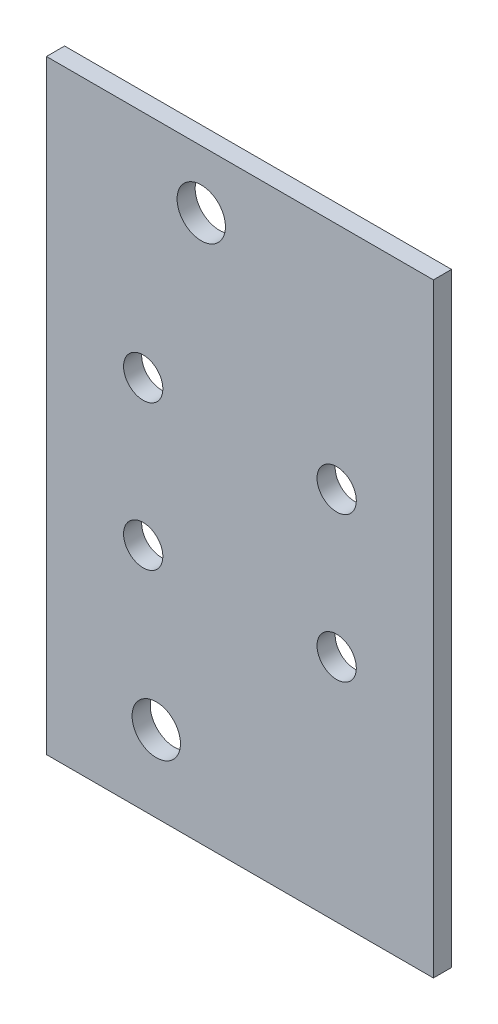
ISO-10303-21;
HEADER;
FILE_DESCRIPTION(('STEP AP214'),'2;1');
FILE_NAME('part.step','',(''),(''),'','','');
FILE_SCHEMA(('AUTOMOTIVE_DESIGN { 1 0 10303 214 1 1 1 1 }'));
ENDSEC;
DATA;
#1=APPLICATION_CONTEXT('core data for automotive mechanical design processes');
#2=APPLICATION_PROTOCOL_DEFINITION('international standard','automotive_design',2000,#1);
#3=PRODUCT_CONTEXT('',#1,'mechanical');
#4=PRODUCT('Part','Part','',(#3));
#5=PRODUCT_RELATED_PRODUCT_CATEGORY('part','',(#4));
#6=PRODUCT_DEFINITION_FORMATION('','',#4);
#7=PRODUCT_DEFINITION_CONTEXT('part definition',#1,'design');
#8=PRODUCT_DEFINITION('design','',#6,#7);
#9=PRODUCT_DEFINITION_SHAPE('','',#8);
#10=(LENGTH_UNIT() NAMED_UNIT(*) SI_UNIT(.MILLI.,.METRE.));
#11=(NAMED_UNIT(*) PLANE_ANGLE_UNIT() SI_UNIT($,.RADIAN.));
#12=(NAMED_UNIT(*) SI_UNIT($,.STERADIAN.) SOLID_ANGLE_UNIT());
#13=UNCERTAINTY_MEASURE_WITH_UNIT(LENGTH_MEASURE(1.E-05),#10,'distance_accuracy_value','');
#14=(GEOMETRIC_REPRESENTATION_CONTEXT(3) GLOBAL_UNCERTAINTY_ASSIGNED_CONTEXT((#13)) GLOBAL_UNIT_ASSIGNED_CONTEXT((#10,
#11,#12)) REPRESENTATION_CONTEXT('',''));
#15=CARTESIAN_POINT('',(0.,0.,0.));
#16=DIRECTION('',(0.,0.,1.));
#17=DIRECTION('',(1.,0.,0.));
#18=AXIS2_PLACEMENT_3D('',#15,#16,#17);
#19=CARTESIAN_POINT('',(0.,0.,9.525));
#20=DIRECTION('',(0.,0.,-1.));
#21=DIRECTION('',(-1.,0.,0.));
#22=AXIS2_PLACEMENT_3D('',#19,#20,#21);
#23=PLANE('',#22);
#24=CARTESIAN_POINT('',(-145.542,-277.368,9.525));
#25=DIRECTION('',(0.,0.,1.));
#26=DIRECTION('',(1.,0.,0.));
#27=AXIS2_PLACEMENT_3D('',#24,#25,#26);
#28=CIRCLE('',#27,12.7);
#29=CARTESIAN_POINT('',(-132.842,-277.368,9.525));
#30=VERTEX_POINT('',#29);
#31=EDGE_CURVE('E140',#30,#30,#28,.T.);
#32=ORIENTED_EDGE('',*,*,#31,.F.);
#33=EDGE_LOOP('',(#32));
#34=FACE_BOUND('',#33,.T.);
#35=CARTESIAN_POINT('',(-121.92,-30.48,9.525));
#36=DIRECTION('',(0.,0.,1.));
#37=DIRECTION('',(1.,0.,0.));
#38=AXIS2_PLACEMENT_3D('',#35,#36,#37);
#39=CIRCLE('',#38,12.7);
#40=CARTESIAN_POINT('',(-109.22,-30.48,9.525));
#41=VERTEX_POINT('',#40);
#42=EDGE_CURVE('E134',#41,#41,#39,.T.);
#43=ORIENTED_EDGE('',*,*,#42,.F.);
#44=EDGE_LOOP('',(#43));
#45=FACE_BOUND('',#44,.T.);
#46=CARTESIAN_POINT('',(-152.4,-196.85,9.525));
#47=DIRECTION('',(0.,0.,-1.));
#48=DIRECTION('',(1.,0.,0.));
#49=AXIS2_PLACEMENT_3D('',#46,#47,#48);
#50=CIRCLE('',#49,10.31875);
#51=CARTESIAN_POINT('',(-142.08125,-196.85,9.525));
#52=VERTEX_POINT('',#51);
#53=EDGE_CURVE('E122',#52,#52,#50,.T.);
#54=ORIENTED_EDGE('',*,*,#53,.T.);
#55=EDGE_LOOP('',(#54));
#56=FACE_BOUND('',#55,.T.);
#57=CARTESIAN_POINT('',(-50.8,-120.65,9.525));
#58=DIRECTION('',(0.,0.,1.));
#59=DIRECTION('',(1.,0.,0.));
#60=AXIS2_PLACEMENT_3D('',#57,#58,#59);
#61=CIRCLE('',#60,10.31875);
#62=CARTESIAN_POINT('',(-40.48125,-120.65,9.525));
#63=VERTEX_POINT('',#62);
#64=EDGE_CURVE('E116',#63,#63,#61,.T.);
#65=ORIENTED_EDGE('',*,*,#64,.F.);
#66=EDGE_LOOP('',(#65));
#67=FACE_BOUND('',#66,.T.);
#68=CARTESIAN_POINT('',(-152.4,-120.65,9.525));
#69=DIRECTION('',(0.,0.,1.));
#70=DIRECTION('',(1.,0.,0.));
#71=AXIS2_PLACEMENT_3D('',#68,#69,#70);
#72=CIRCLE('',#71,10.31875);
#73=CARTESIAN_POINT('',(-142.08125,-120.65,9.525));
#74=VERTEX_POINT('',#73);
#75=EDGE_CURVE('E110',#74,#74,#72,.T.);
#76=ORIENTED_EDGE('',*,*,#75,.F.);
#77=EDGE_LOOP('',(#76));
#78=FACE_BOUND('',#77,.T.);
#79=DIRECTION('',(0.,1.,0.));
#80=VECTOR('',#79,1.);
#81=CARTESIAN_POINT('',(0.,0.,9.525));
#82=LINE('',#81,#80);
#83=CARTESIAN_POINT('',(0.,-317.5,9.525));
#84=VERTEX_POINT('',#83);
#85=CARTESIAN_POINT('',(0.,0.,9.525));
#86=VERTEX_POINT('',#85);
#87=EDGE_CURVE('E83',#84,#86,#82,.T.);
#88=ORIENTED_EDGE('',*,*,#87,.T.);
#89=DIRECTION('',(-1.,0.,0.));
#90=VECTOR('',#89,1.);
#91=CARTESIAN_POINT('',(0.,0.,9.525));
#92=LINE('',#91,#90);
#93=CARTESIAN_POINT('',(-203.2,0.,9.525));
#94=VERTEX_POINT('',#93);
#95=EDGE_CURVE('E78',#86,#94,#92,.T.);
#96=ORIENTED_EDGE('',*,*,#95,.T.);
#97=DIRECTION('',(0.,-1.,0.));
#98=VECTOR('',#97,1.);
#99=CARTESIAN_POINT('',(-203.2,0.,9.525));
#100=LINE('',#99,#98);
#101=CARTESIAN_POINT('',(-203.2,-317.5,9.525));
#102=VERTEX_POINT('',#101);
#103=EDGE_CURVE('E81',#94,#102,#100,.T.);
#104=ORIENTED_EDGE('',*,*,#103,.T.);
#105=DIRECTION('',(1.,0.,0.));
#106=VECTOR('',#105,1.);
#107=CARTESIAN_POINT('',(0.,-317.5,9.525));
#108=LINE('',#107,#106);
#109=EDGE_CURVE('E48',#102,#84,#108,.T.);
#110=ORIENTED_EDGE('',*,*,#109,.T.);
#111=EDGE_LOOP('',(#88,#96,#104,#110));
#112=FACE_BOUND('',#111,.T.);
#113=CARTESIAN_POINT('',(-50.8,-196.85,9.525));
#114=DIRECTION('',(0.,0.,-1.));
#115=DIRECTION('',(1.,0.,0.));
#116=AXIS2_PLACEMENT_3D('',#113,#114,#115);
#117=CIRCLE('',#116,10.31875);
#118=CARTESIAN_POINT('',(-40.48125,-196.85,9.525));
#119=VERTEX_POINT('',#118);
#120=EDGE_CURVE('E128',#119,#119,#117,.T.);
#121=ORIENTED_EDGE('',*,*,#120,.T.);
#122=EDGE_LOOP('',(#121));
#123=FACE_BOUND('',#122,.T.);
#124=ADVANCED_FACE('F31',(#34,#45,#56,#67,#78,#112,#123),#23,.F.);
#125=CARTESIAN_POINT('',(0.,0.,0.));
#126=DIRECTION('',(0.,0.,-1.));
#127=DIRECTION('',(-1.,0.,0.));
#128=AXIS2_PLACEMENT_3D('',#125,#126,#127);
#129=PLANE('',#128);
#130=CARTESIAN_POINT('',(-145.542,-277.368,0.));
#131=DIRECTION('',(0.,0.,1.));
#132=DIRECTION('',(1.,0.,0.));
#133=AXIS2_PLACEMENT_3D('',#130,#131,#132);
#134=CIRCLE('',#133,12.7);
#135=CARTESIAN_POINT('',(-132.842,-277.368,0.));
#136=VERTEX_POINT('',#135);
#137=EDGE_CURVE('E137',#136,#136,#134,.T.);
#138=ORIENTED_EDGE('',*,*,#137,.T.);
#139=EDGE_LOOP('',(#138));
#140=FACE_BOUND('',#139,.T.);
#141=CARTESIAN_POINT('',(-121.92,-30.48,0.));
#142=DIRECTION('',(0.,0.,1.));
#143=DIRECTION('',(1.,0.,0.));
#144=AXIS2_PLACEMENT_3D('',#141,#142,#143);
#145=CIRCLE('',#144,12.7);
#146=CARTESIAN_POINT('',(-109.22,-30.48,0.));
#147=VERTEX_POINT('',#146);
#148=EDGE_CURVE('E131',#147,#147,#145,.T.);
#149=ORIENTED_EDGE('',*,*,#148,.T.);
#150=EDGE_LOOP('',(#149));
#151=FACE_BOUND('',#150,.T.);
#152=CARTESIAN_POINT('',(-152.4,-196.85,0.));
#153=DIRECTION('',(0.,0.,-1.));
#154=DIRECTION('',(1.,0.,0.));
#155=AXIS2_PLACEMENT_3D('',#152,#153,#154);
#156=CIRCLE('',#155,10.31875);
#157=CARTESIAN_POINT('',(-142.08125,-196.85,0.));
#158=VERTEX_POINT('',#157);
#159=EDGE_CURVE('E119',#158,#158,#156,.T.);
#160=ORIENTED_EDGE('',*,*,#159,.F.);
#161=EDGE_LOOP('',(#160));
#162=FACE_BOUND('',#161,.T.);
#163=CARTESIAN_POINT('',(-50.8,-120.65,0.));
#164=DIRECTION('',(0.,0.,1.));
#165=DIRECTION('',(1.,0.,0.));
#166=AXIS2_PLACEMENT_3D('',#163,#164,#165);
#167=CIRCLE('',#166,10.31875);
#168=CARTESIAN_POINT('',(-40.48125,-120.65,0.));
#169=VERTEX_POINT('',#168);
#170=EDGE_CURVE('E113',#169,#169,#167,.T.);
#171=ORIENTED_EDGE('',*,*,#170,.T.);
#172=EDGE_LOOP('',(#171));
#173=FACE_BOUND('',#172,.T.);
#174=CARTESIAN_POINT('',(-152.4,-120.65,0.));
#175=DIRECTION('',(0.,0.,1.));
#176=DIRECTION('',(1.,0.,0.));
#177=AXIS2_PLACEMENT_3D('',#174,#175,#176);
#178=CIRCLE('',#177,10.31875);
#179=CARTESIAN_POINT('',(-142.08125,-120.65,0.));
#180=VERTEX_POINT('',#179);
#181=EDGE_CURVE('E98',#180,#180,#178,.T.);
#182=ORIENTED_EDGE('',*,*,#181,.T.);
#183=EDGE_LOOP('',(#182));
#184=FACE_BOUND('',#183,.T.);
#185=DIRECTION('',(0.,1.,0.));
#186=VECTOR('',#185,1.);
#187=CARTESIAN_POINT('',(0.,0.,0.));
#188=LINE('',#187,#186);
#189=CARTESIAN_POINT('',(0.,-317.5,0.));
#190=VERTEX_POINT('',#189);
#191=CARTESIAN_POINT('',(0.,0.,0.));
#192=VERTEX_POINT('',#191);
#193=EDGE_CURVE('E95',#190,#192,#188,.T.);
#194=ORIENTED_EDGE('',*,*,#193,.F.);
#195=DIRECTION('',(1.,0.,0.));
#196=VECTOR('',#195,1.);
#197=CARTESIAN_POINT('',(0.,-317.5,0.));
#198=LINE('',#197,#196);
#199=CARTESIAN_POINT('',(-203.2,-317.5,0.));
#200=VERTEX_POINT('',#199);
#201=EDGE_CURVE('E71',#200,#190,#198,.T.);
#202=ORIENTED_EDGE('',*,*,#201,.F.);
#203=DIRECTION('',(0.,-1.,0.));
#204=VECTOR('',#203,1.);
#205=CARTESIAN_POINT('',(-203.2,0.,0.));
#206=LINE('',#205,#204);
#207=CARTESIAN_POINT('',(-203.2,0.,0.));
#208=VERTEX_POINT('',#207);
#209=EDGE_CURVE('E65',#208,#200,#206,.T.);
#210=ORIENTED_EDGE('',*,*,#209,.F.);
#211=DIRECTION('',(-1.,0.,0.));
#212=VECTOR('',#211,1.);
#213=CARTESIAN_POINT('',(0.,0.,0.));
#214=LINE('',#213,#212);
#215=EDGE_CURVE('E87',#192,#208,#214,.T.);
#216=ORIENTED_EDGE('',*,*,#215,.F.);
#217=EDGE_LOOP('',(#194,#202,#210,#216));
#218=FACE_BOUND('',#217,.T.);
#219=CARTESIAN_POINT('',(-50.8,-196.85,0.));
#220=DIRECTION('',(0.,0.,-1.));
#221=DIRECTION('',(1.,0.,0.));
#222=AXIS2_PLACEMENT_3D('',#219,#220,#221);
#223=CIRCLE('',#222,10.31875);
#224=CARTESIAN_POINT('',(-40.48125,-196.85,0.));
#225=VERTEX_POINT('',#224);
#226=EDGE_CURVE('E125',#225,#225,#223,.T.);
#227=ORIENTED_EDGE('',*,*,#226,.F.);
#228=EDGE_LOOP('',(#227));
#229=FACE_BOUND('',#228,.T.);
#230=ADVANCED_FACE('F106',(#140,#151,#162,#173,#184,#218,#229),#129,.T.);
#231=CARTESIAN_POINT('',(0.,0.,9.525));
#232=DIRECTION('',(-1.,0.,0.));
#233=DIRECTION('',(0.,-1.,0.));
#234=AXIS2_PLACEMENT_3D('',#231,#232,#233);
#235=PLANE('',#234);
#236=ORIENTED_EDGE('',*,*,#193,.T.);
#237=DIRECTION('',(0.,0.,-1.));
#238=VECTOR('',#237,1.);
#239=CARTESIAN_POINT('',(0.,0.,9.525));
#240=LINE('',#239,#238);
#241=EDGE_CURVE('E11',#86,#192,#240,.T.);
#242=ORIENTED_EDGE('',*,*,#241,.F.);
#243=ORIENTED_EDGE('',*,*,#87,.F.);
#244=DIRECTION('',(0.,0.,-1.));
#245=VECTOR('',#244,1.);
#246=CARTESIAN_POINT('',(0.,-317.5,9.525));
#247=LINE('',#246,#245);
#248=EDGE_CURVE('E91',#84,#190,#247,.T.);
#249=ORIENTED_EDGE('',*,*,#248,.T.);
#250=EDGE_LOOP('',(#236,#242,#243,#249));
#251=FACE_BOUND('',#250,.T.);
#252=ADVANCED_FACE('F33',(#251),#235,.F.);
#253=CARTESIAN_POINT('',(0.,0.,9.525));
#254=DIRECTION('',(0.,-1.,0.));
#255=DIRECTION('',(1.,0.,0.));
#256=AXIS2_PLACEMENT_3D('',#253,#254,#255);
#257=PLANE('',#256);
#258=ORIENTED_EDGE('',*,*,#215,.T.);
#259=DIRECTION('',(0.,0.,-1.));
#260=VECTOR('',#259,1.);
#261=CARTESIAN_POINT('',(-203.2,0.,9.525));
#262=LINE('',#261,#260);
#263=EDGE_CURVE('E40',#94,#208,#262,.T.);
#264=ORIENTED_EDGE('',*,*,#263,.F.);
#265=ORIENTED_EDGE('',*,*,#95,.F.);
#266=ORIENTED_EDGE('',*,*,#241,.T.);
#267=EDGE_LOOP('',(#258,#264,#265,#266));
#268=FACE_BOUND('',#267,.T.);
#269=ADVANCED_FACE('F86',(#268),#257,.F.);
#270=CARTESIAN_POINT('',(-203.2,0.,9.525));
#271=DIRECTION('',(1.,0.,0.));
#272=DIRECTION('',(0.,1.,0.));
#273=AXIS2_PLACEMENT_3D('',#270,#271,#272);
#274=PLANE('',#273);
#275=ORIENTED_EDGE('',*,*,#209,.T.);
#276=DIRECTION('',(0.,0.,-1.));
#277=VECTOR('',#276,1.);
#278=CARTESIAN_POINT('',(-203.2,-317.5,9.525));
#279=LINE('',#278,#277);
#280=EDGE_CURVE('E88',#102,#200,#279,.T.);
#281=ORIENTED_EDGE('',*,*,#280,.F.);
#282=ORIENTED_EDGE('',*,*,#103,.F.);
#283=ORIENTED_EDGE('',*,*,#263,.T.);
#284=EDGE_LOOP('',(#275,#281,#282,#283));
#285=FACE_BOUND('',#284,.T.);
#286=ADVANCED_FACE('F89',(#285),#274,.F.);
#287=CARTESIAN_POINT('',(0.,-317.5,9.525));
#288=DIRECTION('',(0.,1.,0.));
#289=DIRECTION('',(0.,0.,1.));
#290=AXIS2_PLACEMENT_3D('',#287,#288,#289);
#291=PLANE('',#290);
#292=ORIENTED_EDGE('',*,*,#201,.T.);
#293=ORIENTED_EDGE('',*,*,#248,.F.);
#294=ORIENTED_EDGE('',*,*,#109,.F.);
#295=ORIENTED_EDGE('',*,*,#280,.T.);
#296=EDGE_LOOP('',(#292,#293,#294,#295));
#297=FACE_BOUND('',#296,.T.);
#298=ADVANCED_FACE('F103',(#297),#291,.F.);
#299=CARTESIAN_POINT('',(-152.4,-120.65,0.));
#300=DIRECTION('',(0.,0.,1.));
#301=DIRECTION('',(1.,0.,0.));
#302=AXIS2_PLACEMENT_3D('',#299,#300,#301);
#303=CYLINDRICAL_SURFACE('',#302,10.31875);
#304=CARTESIAN_POINT('',(-142.08125,-120.65,0.));
#305=CARTESIAN_POINT('',(-142.08125,-120.65,0.0992187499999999));
#306=CARTESIAN_POINT('',(-142.08125,-120.65,0.1984375));
#307=CARTESIAN_POINT('',(-142.08125,-120.65,0.396875));
#308=CARTESIAN_POINT('',(-142.08125,-120.65,0.49609375));
#309=CARTESIAN_POINT('',(-142.08125,-120.65,0.69453125));
#310=CARTESIAN_POINT('',(-142.08125,-120.65,0.79375));
#311=CARTESIAN_POINT('',(-142.08125,-120.65,0.9921875));
#312=CARTESIAN_POINT('',(-142.08125,-120.65,1.09140625));
#313=CARTESIAN_POINT('',(-142.08125,-120.65,1.28984375));
#314=CARTESIAN_POINT('',(-142.08125,-120.65,1.3890625));
#315=CARTESIAN_POINT('',(-142.08125,-120.65,1.5875));
#316=CARTESIAN_POINT('',(-142.08125,-120.65,1.68671875));
#317=CARTESIAN_POINT('',(-142.08125,-120.65,1.88515625));
#318=CARTESIAN_POINT('',(-142.08125,-120.65,1.984375));
#319=CARTESIAN_POINT('',(-142.08125,-120.65,2.1828125));
#320=CARTESIAN_POINT('',(-142.08125,-120.65,2.28203125));
#321=CARTESIAN_POINT('',(-142.08125,-120.65,2.48046875));
#322=CARTESIAN_POINT('',(-142.08125,-120.65,2.5796875));
#323=CARTESIAN_POINT('',(-142.08125,-120.65,2.778125));
#324=CARTESIAN_POINT('',(-142.08125,-120.65,2.87734375));
#325=CARTESIAN_POINT('',(-142.08125,-120.65,3.07578125));
#326=CARTESIAN_POINT('',(-142.08125,-120.65,3.175));
#327=CARTESIAN_POINT('',(-142.08125,-120.65,3.3734375));
#328=CARTESIAN_POINT('',(-142.08125,-120.65,3.47265625));
#329=CARTESIAN_POINT('',(-142.08125,-120.65,3.67109375));
#330=CARTESIAN_POINT('',(-142.08125,-120.65,3.7703125));
#331=CARTESIAN_POINT('',(-142.08125,-120.65,3.96875));
#332=CARTESIAN_POINT('',(-142.08125,-120.65,4.06796875));
#333=CARTESIAN_POINT('',(-142.08125,-120.65,4.26640625));
#334=CARTESIAN_POINT('',(-142.08125,-120.65,4.365625));
#335=CARTESIAN_POINT('',(-142.08125,-120.65,4.5640625));
#336=CARTESIAN_POINT('',(-142.08125,-120.65,4.66328125));
#337=CARTESIAN_POINT('',(-142.08125,-120.65,4.86171875));
#338=CARTESIAN_POINT('',(-142.08125,-120.65,4.9609375));
#339=CARTESIAN_POINT('',(-142.08125,-120.65,5.159375));
#340=CARTESIAN_POINT('',(-142.08125,-120.65,5.25859375));
#341=CARTESIAN_POINT('',(-142.08125,-120.65,5.45703125));
#342=CARTESIAN_POINT('',(-142.08125,-120.65,5.55625));
#343=CARTESIAN_POINT('',(-142.08125,-120.65,5.7546875));
#344=CARTESIAN_POINT('',(-142.08125,-120.65,5.85390625));
#345=CARTESIAN_POINT('',(-142.08125,-120.65,6.05234375));
#346=CARTESIAN_POINT('',(-142.08125,-120.65,6.1515625));
#347=CARTESIAN_POINT('',(-142.08125,-120.65,6.35));
#348=CARTESIAN_POINT('',(-142.08125,-120.65,6.44921875));
#349=CARTESIAN_POINT('',(-142.08125,-120.65,6.64765625));
#350=CARTESIAN_POINT('',(-142.08125,-120.65,6.746875));
#351=CARTESIAN_POINT('',(-142.08125,-120.65,6.9453125));
#352=CARTESIAN_POINT('',(-142.08125,-120.65,7.04453125));
#353=CARTESIAN_POINT('',(-142.08125,-120.65,7.24296875));
#354=CARTESIAN_POINT('',(-142.08125,-120.65,7.3421875));
#355=CARTESIAN_POINT('',(-142.08125,-120.65,7.540625));
#356=CARTESIAN_POINT('',(-142.08125,-120.65,7.63984375));
#357=CARTESIAN_POINT('',(-142.08125,-120.65,7.83828125));
#358=CARTESIAN_POINT('',(-142.08125,-120.65,7.9375));
#359=CARTESIAN_POINT('',(-142.08125,-120.65,8.1359375));
#360=CARTESIAN_POINT('',(-142.08125,-120.65,8.23515625));
#361=CARTESIAN_POINT('',(-142.08125,-120.65,8.43359375));
#362=CARTESIAN_POINT('',(-142.08125,-120.65,8.5328125));
#363=CARTESIAN_POINT('',(-142.08125,-120.65,8.73125));
#364=CARTESIAN_POINT('',(-142.08125,-120.65,8.83046875));
#365=CARTESIAN_POINT('',(-142.08125,-120.65,9.02890625));
#366=CARTESIAN_POINT('',(-142.08125,-120.65,9.128125));
#367=CARTESIAN_POINT('',(-142.08125,-120.65,9.3265625));
#368=CARTESIAN_POINT('',(-142.08125,-120.65,9.42578125));
#369=CARTESIAN_POINT('',(-142.08125,-120.65,9.525));
#370=B_SPLINE_CURVE_WITH_KNOTS('',3,(#304,#305,#306,#307,#308,#309,#310,#311,#312,#313,#314,
#315,#316,#317,#318,#319,#320,#321,#322,#323,#324,#325,#326,#327,#328,#329,#330,#331,#332,#333,
#334,#335,#336,#337,#338,#339,#340,#341,#342,#343,#344,#345,#346,#347,#348,#349,#350,#351,#352,
#353,#354,#355,#356,#357,#358,#359,#360,#361,#362,#363,#364,#365,#366,#367,#368,#369),
.UNSPECIFIED.,.F.,.F.,(4,2,2,2,2,2,2,2,2,2,2,2,2,2,2,2,2,2,2,2,2,2,2,2,2,2,2,2,2,2,2,2,4),(0.,
0.29765625,0.5953125,0.89296875,1.190625,1.48828125,1.7859375,2.08359375,2.38125,2.67890625,
2.9765625,3.27421875,3.571875,3.86953125,4.1671875,4.46484375,4.7625,5.06015625,5.3578125,
5.65546875,5.953125,6.25078125,6.5484375,6.84609375,7.14375,7.44140625,7.7390625,8.03671875,
8.334375,8.63203125,8.9296875,9.22734375,9.525),.UNSPECIFIED.);
#371=EDGE_CURVE('BSEAM166',#180,#74,#370,.T.);
#372=ORIENTED_EDGE('',*,*,#181,.F.);
#373=ORIENTED_EDGE('',*,*,#75,.T.);
#374=ORIENTED_EDGE('',*,*,#371,.T.);
#375=ORIENTED_EDGE('',*,*,#371,.F.);
#376=EDGE_LOOP('',(#372,#374,#373,#375));
#377=FACE_BOUND('',#376,.T.);
#378=ADVANCED_FACE('F166',(#377),#303,.F.);
#379=CARTESIAN_POINT('',(-50.8,-120.65,0.));
#380=DIRECTION('',(0.,0.,1.));
#381=DIRECTION('',(1.,0.,0.));
#382=AXIS2_PLACEMENT_3D('',#379,#380,#381);
#383=CYLINDRICAL_SURFACE('',#382,10.31875);
#384=CARTESIAN_POINT('',(-40.48125,-120.65,0.));
#385=CARTESIAN_POINT('',(-40.48125,-120.65,0.0992187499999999));
#386=CARTESIAN_POINT('',(-40.48125,-120.65,0.1984375));
#387=CARTESIAN_POINT('',(-40.48125,-120.65,0.396875));
#388=CARTESIAN_POINT('',(-40.48125,-120.65,0.49609375));
#389=CARTESIAN_POINT('',(-40.48125,-120.65,0.69453125));
#390=CARTESIAN_POINT('',(-40.48125,-120.65,0.79375));
#391=CARTESIAN_POINT('',(-40.48125,-120.65,0.9921875));
#392=CARTESIAN_POINT('',(-40.48125,-120.65,1.09140625));
#393=CARTESIAN_POINT('',(-40.48125,-120.65,1.28984375));
#394=CARTESIAN_POINT('',(-40.48125,-120.65,1.3890625));
#395=CARTESIAN_POINT('',(-40.48125,-120.65,1.5875));
#396=CARTESIAN_POINT('',(-40.48125,-120.65,1.68671875));
#397=CARTESIAN_POINT('',(-40.48125,-120.65,1.88515625));
#398=CARTESIAN_POINT('',(-40.48125,-120.65,1.984375));
#399=CARTESIAN_POINT('',(-40.48125,-120.65,2.1828125));
#400=CARTESIAN_POINT('',(-40.48125,-120.65,2.28203125));
#401=CARTESIAN_POINT('',(-40.48125,-120.65,2.48046875));
#402=CARTESIAN_POINT('',(-40.48125,-120.65,2.5796875));
#403=CARTESIAN_POINT('',(-40.48125,-120.65,2.778125));
#404=CARTESIAN_POINT('',(-40.48125,-120.65,2.87734375));
#405=CARTESIAN_POINT('',(-40.48125,-120.65,3.07578125));
#406=CARTESIAN_POINT('',(-40.48125,-120.65,3.175));
#407=CARTESIAN_POINT('',(-40.48125,-120.65,3.3734375));
#408=CARTESIAN_POINT('',(-40.48125,-120.65,3.47265625));
#409=CARTESIAN_POINT('',(-40.48125,-120.65,3.67109375));
#410=CARTESIAN_POINT('',(-40.48125,-120.65,3.7703125));
#411=CARTESIAN_POINT('',(-40.48125,-120.65,3.96875));
#412=CARTESIAN_POINT('',(-40.48125,-120.65,4.06796875));
#413=CARTESIAN_POINT('',(-40.48125,-120.65,4.26640625));
#414=CARTESIAN_POINT('',(-40.48125,-120.65,4.365625));
#415=CARTESIAN_POINT('',(-40.48125,-120.65,4.5640625));
#416=CARTESIAN_POINT('',(-40.48125,-120.65,4.66328125));
#417=CARTESIAN_POINT('',(-40.48125,-120.65,4.86171875));
#418=CARTESIAN_POINT('',(-40.48125,-120.65,4.9609375));
#419=CARTESIAN_POINT('',(-40.48125,-120.65,5.159375));
#420=CARTESIAN_POINT('',(-40.48125,-120.65,5.25859375));
#421=CARTESIAN_POINT('',(-40.48125,-120.65,5.45703125));
#422=CARTESIAN_POINT('',(-40.48125,-120.65,5.55625));
#423=CARTESIAN_POINT('',(-40.48125,-120.65,5.7546875));
#424=CARTESIAN_POINT('',(-40.48125,-120.65,5.85390625));
#425=CARTESIAN_POINT('',(-40.48125,-120.65,6.05234375));
#426=CARTESIAN_POINT('',(-40.48125,-120.65,6.1515625));
#427=CARTESIAN_POINT('',(-40.48125,-120.65,6.35));
#428=CARTESIAN_POINT('',(-40.48125,-120.65,6.44921875));
#429=CARTESIAN_POINT('',(-40.48125,-120.65,6.64765625));
#430=CARTESIAN_POINT('',(-40.48125,-120.65,6.746875));
#431=CARTESIAN_POINT('',(-40.48125,-120.65,6.9453125));
#432=CARTESIAN_POINT('',(-40.48125,-120.65,7.04453125));
#433=CARTESIAN_POINT('',(-40.48125,-120.65,7.24296875));
#434=CARTESIAN_POINT('',(-40.48125,-120.65,7.3421875));
#435=CARTESIAN_POINT('',(-40.48125,-120.65,7.540625));
#436=CARTESIAN_POINT('',(-40.48125,-120.65,7.63984375));
#437=CARTESIAN_POINT('',(-40.48125,-120.65,7.83828125));
#438=CARTESIAN_POINT('',(-40.48125,-120.65,7.9375));
#439=CARTESIAN_POINT('',(-40.48125,-120.65,8.1359375));
#440=CARTESIAN_POINT('',(-40.48125,-120.65,8.23515625));
#441=CARTESIAN_POINT('',(-40.48125,-120.65,8.43359375));
#442=CARTESIAN_POINT('',(-40.48125,-120.65,8.5328125));
#443=CARTESIAN_POINT('',(-40.48125,-120.65,8.73125));
#444=CARTESIAN_POINT('',(-40.48125,-120.65,8.83046875));
#445=CARTESIAN_POINT('',(-40.48125,-120.65,9.02890625));
#446=CARTESIAN_POINT('',(-40.48125,-120.65,9.128125));
#447=CARTESIAN_POINT('',(-40.48125,-120.65,9.3265625));
#448=CARTESIAN_POINT('',(-40.48125,-120.65,9.42578125));
#449=CARTESIAN_POINT('',(-40.48125,-120.65,9.525));
#450=B_SPLINE_CURVE_WITH_KNOTS('',3,(#384,#385,#386,#387,#388,#389,#390,#391,#392,#393,#394,
#395,#396,#397,#398,#399,#400,#401,#402,#403,#404,#405,#406,#407,#408,#409,#410,#411,#412,#413,
#414,#415,#416,#417,#418,#419,#420,#421,#422,#423,#424,#425,#426,#427,#428,#429,#430,#431,#432,
#433,#434,#435,#436,#437,#438,#439,#440,#441,#442,#443,#444,#445,#446,#447,#448,#449),
.UNSPECIFIED.,.F.,.F.,(4,2,2,2,2,2,2,2,2,2,2,2,2,2,2,2,2,2,2,2,2,2,2,2,2,2,2,2,2,2,2,2,4),(0.,
0.29765625,0.5953125,0.89296875,1.190625,1.48828125,1.7859375,2.08359375,2.38125,2.67890625,
2.9765625,3.27421875,3.571875,3.86953125,4.1671875,4.46484375,4.7625,5.06015625,5.3578125,
5.65546875,5.953125,6.25078125,6.5484375,6.84609375,7.14375,7.44140625,7.7390625,8.03671875,
8.334375,8.63203125,8.9296875,9.22734375,9.525),.UNSPECIFIED.);
#451=EDGE_CURVE('BSEAM168',#169,#63,#450,.T.);
#452=ORIENTED_EDGE('',*,*,#170,.F.);
#453=ORIENTED_EDGE('',*,*,#64,.T.);
#454=ORIENTED_EDGE('',*,*,#451,.T.);
#455=ORIENTED_EDGE('',*,*,#451,.F.);
#456=EDGE_LOOP('',(#452,#454,#453,#455));
#457=FACE_BOUND('',#456,.T.);
#458=ADVANCED_FACE('F168',(#457),#383,.F.);
#459=CARTESIAN_POINT('',(-152.4,-196.85,0.));
#460=DIRECTION('',(0.,0.,1.));
#461=DIRECTION('',(1.,0.,0.));
#462=AXIS2_PLACEMENT_3D('',#459,#460,#461);
#463=CYLINDRICAL_SURFACE('',#462,10.31875);
#464=CARTESIAN_POINT('',(-142.08125,-196.85,0.));
#465=CARTESIAN_POINT('',(-142.08125,-196.85,0.0992187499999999));
#466=CARTESIAN_POINT('',(-142.08125,-196.85,0.1984375));
#467=CARTESIAN_POINT('',(-142.08125,-196.85,0.396875));
#468=CARTESIAN_POINT('',(-142.08125,-196.85,0.49609375));
#469=CARTESIAN_POINT('',(-142.08125,-196.85,0.69453125));
#470=CARTESIAN_POINT('',(-142.08125,-196.85,0.79375));
#471=CARTESIAN_POINT('',(-142.08125,-196.85,0.9921875));
#472=CARTESIAN_POINT('',(-142.08125,-196.85,1.09140625));
#473=CARTESIAN_POINT('',(-142.08125,-196.85,1.28984375));
#474=CARTESIAN_POINT('',(-142.08125,-196.85,1.3890625));
#475=CARTESIAN_POINT('',(-142.08125,-196.85,1.5875));
#476=CARTESIAN_POINT('',(-142.08125,-196.85,1.68671875));
#477=CARTESIAN_POINT('',(-142.08125,-196.85,1.88515625));
#478=CARTESIAN_POINT('',(-142.08125,-196.85,1.984375));
#479=CARTESIAN_POINT('',(-142.08125,-196.85,2.1828125));
#480=CARTESIAN_POINT('',(-142.08125,-196.85,2.28203125));
#481=CARTESIAN_POINT('',(-142.08125,-196.85,2.48046875));
#482=CARTESIAN_POINT('',(-142.08125,-196.85,2.5796875));
#483=CARTESIAN_POINT('',(-142.08125,-196.85,2.778125));
#484=CARTESIAN_POINT('',(-142.08125,-196.85,2.87734375));
#485=CARTESIAN_POINT('',(-142.08125,-196.85,3.07578125));
#486=CARTESIAN_POINT('',(-142.08125,-196.85,3.175));
#487=CARTESIAN_POINT('',(-142.08125,-196.85,3.3734375));
#488=CARTESIAN_POINT('',(-142.08125,-196.85,3.47265625));
#489=CARTESIAN_POINT('',(-142.08125,-196.85,3.67109375));
#490=CARTESIAN_POINT('',(-142.08125,-196.85,3.7703125));
#491=CARTESIAN_POINT('',(-142.08125,-196.85,3.96875));
#492=CARTESIAN_POINT('',(-142.08125,-196.85,4.06796875));
#493=CARTESIAN_POINT('',(-142.08125,-196.85,4.26640625));
#494=CARTESIAN_POINT('',(-142.08125,-196.85,4.365625));
#495=CARTESIAN_POINT('',(-142.08125,-196.85,4.5640625));
#496=CARTESIAN_POINT('',(-142.08125,-196.85,4.66328125));
#497=CARTESIAN_POINT('',(-142.08125,-196.85,4.86171875));
#498=CARTESIAN_POINT('',(-142.08125,-196.85,4.9609375));
#499=CARTESIAN_POINT('',(-142.08125,-196.85,5.159375));
#500=CARTESIAN_POINT('',(-142.08125,-196.85,5.25859375));
#501=CARTESIAN_POINT('',(-142.08125,-196.85,5.45703125));
#502=CARTESIAN_POINT('',(-142.08125,-196.85,5.55625));
#503=CARTESIAN_POINT('',(-142.08125,-196.85,5.7546875));
#504=CARTESIAN_POINT('',(-142.08125,-196.85,5.85390625));
#505=CARTESIAN_POINT('',(-142.08125,-196.85,6.05234375));
#506=CARTESIAN_POINT('',(-142.08125,-196.85,6.1515625));
#507=CARTESIAN_POINT('',(-142.08125,-196.85,6.35));
#508=CARTESIAN_POINT('',(-142.08125,-196.85,6.44921875));
#509=CARTESIAN_POINT('',(-142.08125,-196.85,6.64765625));
#510=CARTESIAN_POINT('',(-142.08125,-196.85,6.746875));
#511=CARTESIAN_POINT('',(-142.08125,-196.85,6.9453125));
#512=CARTESIAN_POINT('',(-142.08125,-196.85,7.04453125));
#513=CARTESIAN_POINT('',(-142.08125,-196.85,7.24296875));
#514=CARTESIAN_POINT('',(-142.08125,-196.85,7.3421875));
#515=CARTESIAN_POINT('',(-142.08125,-196.85,7.540625));
#516=CARTESIAN_POINT('',(-142.08125,-196.85,7.63984375));
#517=CARTESIAN_POINT('',(-142.08125,-196.85,7.83828125));
#518=CARTESIAN_POINT('',(-142.08125,-196.85,7.9375));
#519=CARTESIAN_POINT('',(-142.08125,-196.85,8.1359375));
#520=CARTESIAN_POINT('',(-142.08125,-196.85,8.23515625));
#521=CARTESIAN_POINT('',(-142.08125,-196.85,8.43359375));
#522=CARTESIAN_POINT('',(-142.08125,-196.85,8.5328125));
#523=CARTESIAN_POINT('',(-142.08125,-196.85,8.73125));
#524=CARTESIAN_POINT('',(-142.08125,-196.85,8.83046875));
#525=CARTESIAN_POINT('',(-142.08125,-196.85,9.02890625));
#526=CARTESIAN_POINT('',(-142.08125,-196.85,9.128125));
#527=CARTESIAN_POINT('',(-142.08125,-196.85,9.3265625));
#528=CARTESIAN_POINT('',(-142.08125,-196.85,9.42578125));
#529=CARTESIAN_POINT('',(-142.08125,-196.85,9.525));
#530=B_SPLINE_CURVE_WITH_KNOTS('',3,(#464,#465,#466,#467,#468,#469,#470,#471,#472,#473,#474,
#475,#476,#477,#478,#479,#480,#481,#482,#483,#484,#485,#486,#487,#488,#489,#490,#491,#492,#493,
#494,#495,#496,#497,#498,#499,#500,#501,#502,#503,#504,#505,#506,#507,#508,#509,#510,#511,#512,
#513,#514,#515,#516,#517,#518,#519,#520,#521,#522,#523,#524,#525,#526,#527,#528,#529),
.UNSPECIFIED.,.F.,.F.,(4,2,2,2,2,2,2,2,2,2,2,2,2,2,2,2,2,2,2,2,2,2,2,2,2,2,2,2,2,2,2,2,4),(0.,
0.29765625,0.5953125,0.89296875,1.190625,1.48828125,1.7859375,2.08359375,2.38125,2.67890625,
2.9765625,3.27421875,3.571875,3.86953125,4.1671875,4.46484375,4.7625,5.06015625,5.3578125,
5.65546875,5.953125,6.25078125,6.5484375,6.84609375,7.14375,7.44140625,7.7390625,8.03671875,
8.334375,8.63203125,8.9296875,9.22734375,9.525),.UNSPECIFIED.);
#531=EDGE_CURVE('BSEAM175',#158,#52,#530,.T.);
#532=ORIENTED_EDGE('',*,*,#159,.T.);
#533=ORIENTED_EDGE('',*,*,#53,.F.);
#534=ORIENTED_EDGE('',*,*,#531,.T.);
#535=ORIENTED_EDGE('',*,*,#531,.F.);
#536=EDGE_LOOP('',(#532,#534,#533,#535));
#537=FACE_BOUND('',#536,.T.);
#538=ADVANCED_FACE('F175',(#537),#463,.F.);
#539=CARTESIAN_POINT('',(-50.8,-196.85,0.));
#540=DIRECTION('',(0.,0.,1.));
#541=DIRECTION('',(1.,0.,0.));
#542=AXIS2_PLACEMENT_3D('',#539,#540,#541);
#543=CYLINDRICAL_SURFACE('',#542,10.31875);
#544=CARTESIAN_POINT('',(-40.48125,-196.85,0.));
#545=CARTESIAN_POINT('',(-40.48125,-196.85,0.0992187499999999));
#546=CARTESIAN_POINT('',(-40.48125,-196.85,0.1984375));
#547=CARTESIAN_POINT('',(-40.48125,-196.85,0.396875));
#548=CARTESIAN_POINT('',(-40.48125,-196.85,0.49609375));
#549=CARTESIAN_POINT('',(-40.48125,-196.85,0.69453125));
#550=CARTESIAN_POINT('',(-40.48125,-196.85,0.79375));
#551=CARTESIAN_POINT('',(-40.48125,-196.85,0.9921875));
#552=CARTESIAN_POINT('',(-40.48125,-196.85,1.09140625));
#553=CARTESIAN_POINT('',(-40.48125,-196.85,1.28984375));
#554=CARTESIAN_POINT('',(-40.48125,-196.85,1.3890625));
#555=CARTESIAN_POINT('',(-40.48125,-196.85,1.5875));
#556=CARTESIAN_POINT('',(-40.48125,-196.85,1.68671875));
#557=CARTESIAN_POINT('',(-40.48125,-196.85,1.88515625));
#558=CARTESIAN_POINT('',(-40.48125,-196.85,1.984375));
#559=CARTESIAN_POINT('',(-40.48125,-196.85,2.1828125));
#560=CARTESIAN_POINT('',(-40.48125,-196.85,2.28203125));
#561=CARTESIAN_POINT('',(-40.48125,-196.85,2.48046875));
#562=CARTESIAN_POINT('',(-40.48125,-196.85,2.5796875));
#563=CARTESIAN_POINT('',(-40.48125,-196.85,2.778125));
#564=CARTESIAN_POINT('',(-40.48125,-196.85,2.87734375));
#565=CARTESIAN_POINT('',(-40.48125,-196.85,3.07578125));
#566=CARTESIAN_POINT('',(-40.48125,-196.85,3.175));
#567=CARTESIAN_POINT('',(-40.48125,-196.85,3.3734375));
#568=CARTESIAN_POINT('',(-40.48125,-196.85,3.47265625));
#569=CARTESIAN_POINT('',(-40.48125,-196.85,3.67109375));
#570=CARTESIAN_POINT('',(-40.48125,-196.85,3.7703125));
#571=CARTESIAN_POINT('',(-40.48125,-196.85,3.96875));
#572=CARTESIAN_POINT('',(-40.48125,-196.85,4.06796875));
#573=CARTESIAN_POINT('',(-40.48125,-196.85,4.26640625));
#574=CARTESIAN_POINT('',(-40.48125,-196.85,4.365625));
#575=CARTESIAN_POINT('',(-40.48125,-196.85,4.5640625));
#576=CARTESIAN_POINT('',(-40.48125,-196.85,4.66328125));
#577=CARTESIAN_POINT('',(-40.48125,-196.85,4.86171875));
#578=CARTESIAN_POINT('',(-40.48125,-196.85,4.9609375));
#579=CARTESIAN_POINT('',(-40.48125,-196.85,5.159375));
#580=CARTESIAN_POINT('',(-40.48125,-196.85,5.25859375));
#581=CARTESIAN_POINT('',(-40.48125,-196.85,5.45703125));
#582=CARTESIAN_POINT('',(-40.48125,-196.85,5.55625));
#583=CARTESIAN_POINT('',(-40.48125,-196.85,5.7546875));
#584=CARTESIAN_POINT('',(-40.48125,-196.85,5.85390625));
#585=CARTESIAN_POINT('',(-40.48125,-196.85,6.05234375));
#586=CARTESIAN_POINT('',(-40.48125,-196.85,6.1515625));
#587=CARTESIAN_POINT('',(-40.48125,-196.85,6.35));
#588=CARTESIAN_POINT('',(-40.48125,-196.85,6.44921875));
#589=CARTESIAN_POINT('',(-40.48125,-196.85,6.64765625));
#590=CARTESIAN_POINT('',(-40.48125,-196.85,6.746875));
#591=CARTESIAN_POINT('',(-40.48125,-196.85,6.9453125));
#592=CARTESIAN_POINT('',(-40.48125,-196.85,7.04453125));
#593=CARTESIAN_POINT('',(-40.48125,-196.85,7.24296875));
#594=CARTESIAN_POINT('',(-40.48125,-196.85,7.3421875));
#595=CARTESIAN_POINT('',(-40.48125,-196.85,7.540625));
#596=CARTESIAN_POINT('',(-40.48125,-196.85,7.63984375));
#597=CARTESIAN_POINT('',(-40.48125,-196.85,7.83828125));
#598=CARTESIAN_POINT('',(-40.48125,-196.85,7.9375));
#599=CARTESIAN_POINT('',(-40.48125,-196.85,8.1359375));
#600=CARTESIAN_POINT('',(-40.48125,-196.85,8.23515625));
#601=CARTESIAN_POINT('',(-40.48125,-196.85,8.43359375));
#602=CARTESIAN_POINT('',(-40.48125,-196.85,8.5328125));
#603=CARTESIAN_POINT('',(-40.48125,-196.85,8.73125));
#604=CARTESIAN_POINT('',(-40.48125,-196.85,8.83046875));
#605=CARTESIAN_POINT('',(-40.48125,-196.85,9.02890625));
#606=CARTESIAN_POINT('',(-40.48125,-196.85,9.128125));
#607=CARTESIAN_POINT('',(-40.48125,-196.85,9.3265625));
#608=CARTESIAN_POINT('',(-40.48125,-196.85,9.42578125));
#609=CARTESIAN_POINT('',(-40.48125,-196.85,9.525));
#610=B_SPLINE_CURVE_WITH_KNOTS('',3,(#544,#545,#546,#547,#548,#549,#550,#551,#552,#553,#554,
#555,#556,#557,#558,#559,#560,#561,#562,#563,#564,#565,#566,#567,#568,#569,#570,#571,#572,#573,
#574,#575,#576,#577,#578,#579,#580,#581,#582,#583,#584,#585,#586,#587,#588,#589,#590,#591,#592,
#593,#594,#595,#596,#597,#598,#599,#600,#601,#602,#603,#604,#605,#606,#607,#608,#609),
.UNSPECIFIED.,.F.,.F.,(4,2,2,2,2,2,2,2,2,2,2,2,2,2,2,2,2,2,2,2,2,2,2,2,2,2,2,2,2,2,2,2,4),(0.,
0.29765625,0.5953125,0.89296875,1.190625,1.48828125,1.7859375,2.08359375,2.38125,2.67890625,
2.9765625,3.27421875,3.571875,3.86953125,4.1671875,4.46484375,4.7625,5.06015625,5.3578125,
5.65546875,5.953125,6.25078125,6.5484375,6.84609375,7.14375,7.44140625,7.7390625,8.03671875,
8.334375,8.63203125,8.9296875,9.22734375,9.525),.UNSPECIFIED.);
#611=EDGE_CURVE('BSEAM210',#225,#119,#610,.T.);
#612=ORIENTED_EDGE('',*,*,#226,.T.);
#613=ORIENTED_EDGE('',*,*,#120,.F.);
#614=ORIENTED_EDGE('',*,*,#611,.T.);
#615=ORIENTED_EDGE('',*,*,#611,.F.);
#616=EDGE_LOOP('',(#612,#614,#613,#615));
#617=FACE_BOUND('',#616,.T.);
#618=ADVANCED_FACE('F210',(#617),#543,.F.);
#619=CARTESIAN_POINT('',(-121.92,-30.48,0.));
#620=DIRECTION('',(0.,0.,1.));
#621=DIRECTION('',(1.,0.,0.));
#622=AXIS2_PLACEMENT_3D('',#619,#620,#621);
#623=CYLINDRICAL_SURFACE('',#622,12.7);
#624=CARTESIAN_POINT('',(-109.22,-30.48,0.));
#625=CARTESIAN_POINT('',(-109.22,-30.48,0.0992187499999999));
#626=CARTESIAN_POINT('',(-109.22,-30.48,0.1984375));
#627=CARTESIAN_POINT('',(-109.22,-30.48,0.396875));
#628=CARTESIAN_POINT('',(-109.22,-30.48,0.49609375));
#629=CARTESIAN_POINT('',(-109.22,-30.48,0.69453125));
#630=CARTESIAN_POINT('',(-109.22,-30.48,0.79375));
#631=CARTESIAN_POINT('',(-109.22,-30.48,0.9921875));
#632=CARTESIAN_POINT('',(-109.22,-30.48,1.09140625));
#633=CARTESIAN_POINT('',(-109.22,-30.48,1.28984375));
#634=CARTESIAN_POINT('',(-109.22,-30.48,1.3890625));
#635=CARTESIAN_POINT('',(-109.22,-30.48,1.5875));
#636=CARTESIAN_POINT('',(-109.22,-30.48,1.68671875));
#637=CARTESIAN_POINT('',(-109.22,-30.48,1.88515625));
#638=CARTESIAN_POINT('',(-109.22,-30.48,1.984375));
#639=CARTESIAN_POINT('',(-109.22,-30.48,2.1828125));
#640=CARTESIAN_POINT('',(-109.22,-30.48,2.28203125));
#641=CARTESIAN_POINT('',(-109.22,-30.48,2.48046875));
#642=CARTESIAN_POINT('',(-109.22,-30.48,2.5796875));
#643=CARTESIAN_POINT('',(-109.22,-30.48,2.778125));
#644=CARTESIAN_POINT('',(-109.22,-30.48,2.87734375));
#645=CARTESIAN_POINT('',(-109.22,-30.48,3.07578125));
#646=CARTESIAN_POINT('',(-109.22,-30.48,3.175));
#647=CARTESIAN_POINT('',(-109.22,-30.48,3.3734375));
#648=CARTESIAN_POINT('',(-109.22,-30.48,3.47265625));
#649=CARTESIAN_POINT('',(-109.22,-30.48,3.67109375));
#650=CARTESIAN_POINT('',(-109.22,-30.48,3.7703125));
#651=CARTESIAN_POINT('',(-109.22,-30.48,3.96875));
#652=CARTESIAN_POINT('',(-109.22,-30.48,4.06796875));
#653=CARTESIAN_POINT('',(-109.22,-30.48,4.26640625));
#654=CARTESIAN_POINT('',(-109.22,-30.48,4.365625));
#655=CARTESIAN_POINT('',(-109.22,-30.48,4.5640625));
#656=CARTESIAN_POINT('',(-109.22,-30.48,4.66328125));
#657=CARTESIAN_POINT('',(-109.22,-30.48,4.86171875));
#658=CARTESIAN_POINT('',(-109.22,-30.48,4.9609375));
#659=CARTESIAN_POINT('',(-109.22,-30.48,5.159375));
#660=CARTESIAN_POINT('',(-109.22,-30.48,5.25859375));
#661=CARTESIAN_POINT('',(-109.22,-30.48,5.45703125));
#662=CARTESIAN_POINT('',(-109.22,-30.48,5.55625));
#663=CARTESIAN_POINT('',(-109.22,-30.48,5.7546875));
#664=CARTESIAN_POINT('',(-109.22,-30.48,5.85390625));
#665=CARTESIAN_POINT('',(-109.22,-30.48,6.05234375));
#666=CARTESIAN_POINT('',(-109.22,-30.48,6.1515625));
#667=CARTESIAN_POINT('',(-109.22,-30.48,6.35));
#668=CARTESIAN_POINT('',(-109.22,-30.48,6.44921875));
#669=CARTESIAN_POINT('',(-109.22,-30.48,6.64765625));
#670=CARTESIAN_POINT('',(-109.22,-30.48,6.746875));
#671=CARTESIAN_POINT('',(-109.22,-30.48,6.9453125));
#672=CARTESIAN_POINT('',(-109.22,-30.48,7.04453125));
#673=CARTESIAN_POINT('',(-109.22,-30.48,7.24296875));
#674=CARTESIAN_POINT('',(-109.22,-30.48,7.3421875));
#675=CARTESIAN_POINT('',(-109.22,-30.48,7.540625));
#676=CARTESIAN_POINT('',(-109.22,-30.48,7.63984375));
#677=CARTESIAN_POINT('',(-109.22,-30.48,7.83828125));
#678=CARTESIAN_POINT('',(-109.22,-30.48,7.9375));
#679=CARTESIAN_POINT('',(-109.22,-30.48,8.1359375));
#680=CARTESIAN_POINT('',(-109.22,-30.48,8.23515625));
#681=CARTESIAN_POINT('',(-109.22,-30.48,8.43359375));
#682=CARTESIAN_POINT('',(-109.22,-30.48,8.5328125));
#683=CARTESIAN_POINT('',(-109.22,-30.48,8.73125));
#684=CARTESIAN_POINT('',(-109.22,-30.48,8.83046875));
#685=CARTESIAN_POINT('',(-109.22,-30.48,9.02890625));
#686=CARTESIAN_POINT('',(-109.22,-30.48,9.128125));
#687=CARTESIAN_POINT('',(-109.22,-30.48,9.3265625));
#688=CARTESIAN_POINT('',(-109.22,-30.48,9.42578125));
#689=CARTESIAN_POINT('',(-109.22,-30.48,9.525));
#690=B_SPLINE_CURVE_WITH_KNOTS('',3,(#624,#625,#626,#627,#628,#629,#630,#631,#632,#633,#634,
#635,#636,#637,#638,#639,#640,#641,#642,#643,#644,#645,#646,#647,#648,#649,#650,#651,#652,#653,
#654,#655,#656,#657,#658,#659,#660,#661,#662,#663,#664,#665,#666,#667,#668,#669,#670,#671,#672,
#673,#674,#675,#676,#677,#678,#679,#680,#681,#682,#683,#684,#685,#686,#687,#688,#689),
.UNSPECIFIED.,.F.,.F.,(4,2,2,2,2,2,2,2,2,2,2,2,2,2,2,2,2,2,2,2,2,2,2,2,2,2,2,2,2,2,2,2,4),(0.,
0.29765625,0.5953125,0.89296875,1.190625,1.48828125,1.7859375,2.08359375,2.38125,2.67890625,
2.9765625,3.27421875,3.571875,3.86953125,4.1671875,4.46484375,4.7625,5.06015625,5.3578125,
5.65546875,5.953125,6.25078125,6.5484375,6.84609375,7.14375,7.44140625,7.7390625,8.03671875,
8.334375,8.63203125,8.9296875,9.22734375,9.525),.UNSPECIFIED.);
#691=EDGE_CURVE('BSEAM151',#147,#41,#690,.T.);
#692=ORIENTED_EDGE('',*,*,#148,.F.);
#693=ORIENTED_EDGE('',*,*,#42,.T.);
#694=ORIENTED_EDGE('',*,*,#691,.T.);
#695=ORIENTED_EDGE('',*,*,#691,.F.);
#696=EDGE_LOOP('',(#692,#694,#693,#695));
#697=FACE_BOUND('',#696,.T.);
#698=ADVANCED_FACE('F151',(#697),#623,.F.);
#699=CARTESIAN_POINT('',(-145.542,-277.368,0.));
#700=DIRECTION('',(0.,0.,1.));
#701=DIRECTION('',(1.,0.,0.));
#702=AXIS2_PLACEMENT_3D('',#699,#700,#701);
#703=CYLINDRICAL_SURFACE('',#702,12.7);
#704=CARTESIAN_POINT('',(-132.842,-277.368,0.));
#705=CARTESIAN_POINT('',(-132.842,-277.368,0.0992187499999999));
#706=CARTESIAN_POINT('',(-132.842,-277.368,0.1984375));
#707=CARTESIAN_POINT('',(-132.842,-277.368,0.396875));
#708=CARTESIAN_POINT('',(-132.842,-277.368,0.49609375));
#709=CARTESIAN_POINT('',(-132.842,-277.368,0.69453125));
#710=CARTESIAN_POINT('',(-132.842,-277.368,0.79375));
#711=CARTESIAN_POINT('',(-132.842,-277.368,0.9921875));
#712=CARTESIAN_POINT('',(-132.842,-277.368,1.09140625));
#713=CARTESIAN_POINT('',(-132.842,-277.368,1.28984375));
#714=CARTESIAN_POINT('',(-132.842,-277.368,1.3890625));
#715=CARTESIAN_POINT('',(-132.842,-277.368,1.5875));
#716=CARTESIAN_POINT('',(-132.842,-277.368,1.68671875));
#717=CARTESIAN_POINT('',(-132.842,-277.368,1.88515625));
#718=CARTESIAN_POINT('',(-132.842,-277.368,1.984375));
#719=CARTESIAN_POINT('',(-132.842,-277.368,2.1828125));
#720=CARTESIAN_POINT('',(-132.842,-277.368,2.28203125));
#721=CARTESIAN_POINT('',(-132.842,-277.368,2.48046875));
#722=CARTESIAN_POINT('',(-132.842,-277.368,2.5796875));
#723=CARTESIAN_POINT('',(-132.842,-277.368,2.778125));
#724=CARTESIAN_POINT('',(-132.842,-277.368,2.87734375));
#725=CARTESIAN_POINT('',(-132.842,-277.368,3.07578125));
#726=CARTESIAN_POINT('',(-132.842,-277.368,3.175));
#727=CARTESIAN_POINT('',(-132.842,-277.368,3.3734375));
#728=CARTESIAN_POINT('',(-132.842,-277.368,3.47265625));
#729=CARTESIAN_POINT('',(-132.842,-277.368,3.67109375));
#730=CARTESIAN_POINT('',(-132.842,-277.368,3.7703125));
#731=CARTESIAN_POINT('',(-132.842,-277.368,3.96875));
#732=CARTESIAN_POINT('',(-132.842,-277.368,4.06796875));
#733=CARTESIAN_POINT('',(-132.842,-277.368,4.26640625));
#734=CARTESIAN_POINT('',(-132.842,-277.368,4.365625));
#735=CARTESIAN_POINT('',(-132.842,-277.368,4.5640625));
#736=CARTESIAN_POINT('',(-132.842,-277.368,4.66328125));
#737=CARTESIAN_POINT('',(-132.842,-277.368,4.86171875));
#738=CARTESIAN_POINT('',(-132.842,-277.368,4.9609375));
#739=CARTESIAN_POINT('',(-132.842,-277.368,5.159375));
#740=CARTESIAN_POINT('',(-132.842,-277.368,5.25859375));
#741=CARTESIAN_POINT('',(-132.842,-277.368,5.45703125));
#742=CARTESIAN_POINT('',(-132.842,-277.368,5.55625));
#743=CARTESIAN_POINT('',(-132.842,-277.368,5.7546875));
#744=CARTESIAN_POINT('',(-132.842,-277.368,5.85390625));
#745=CARTESIAN_POINT('',(-132.842,-277.368,6.05234375));
#746=CARTESIAN_POINT('',(-132.842,-277.368,6.1515625));
#747=CARTESIAN_POINT('',(-132.842,-277.368,6.35));
#748=CARTESIAN_POINT('',(-132.842,-277.368,6.44921875));
#749=CARTESIAN_POINT('',(-132.842,-277.368,6.64765625));
#750=CARTESIAN_POINT('',(-132.842,-277.368,6.746875));
#751=CARTESIAN_POINT('',(-132.842,-277.368,6.9453125));
#752=CARTESIAN_POINT('',(-132.842,-277.368,7.04453125));
#753=CARTESIAN_POINT('',(-132.842,-277.368,7.24296875));
#754=CARTESIAN_POINT('',(-132.842,-277.368,7.3421875));
#755=CARTESIAN_POINT('',(-132.842,-277.368,7.540625));
#756=CARTESIAN_POINT('',(-132.842,-277.368,7.63984375));
#757=CARTESIAN_POINT('',(-132.842,-277.368,7.83828125));
#758=CARTESIAN_POINT('',(-132.842,-277.368,7.9375));
#759=CARTESIAN_POINT('',(-132.842,-277.368,8.1359375));
#760=CARTESIAN_POINT('',(-132.842,-277.368,8.23515625));
#761=CARTESIAN_POINT('',(-132.842,-277.368,8.43359375));
#762=CARTESIAN_POINT('',(-132.842,-277.368,8.5328125));
#763=CARTESIAN_POINT('',(-132.842,-277.368,8.73125));
#764=CARTESIAN_POINT('',(-132.842,-277.368,8.83046875));
#765=CARTESIAN_POINT('',(-132.842,-277.368,9.02890625));
#766=CARTESIAN_POINT('',(-132.842,-277.368,9.128125));
#767=CARTESIAN_POINT('',(-132.842,-277.368,9.3265625));
#768=CARTESIAN_POINT('',(-132.842,-277.368,9.42578125));
#769=CARTESIAN_POINT('',(-132.842,-277.368,9.525));
#770=B_SPLINE_CURVE_WITH_KNOTS('',3,(#704,#705,#706,#707,#708,#709,#710,#711,#712,#713,#714,
#715,#716,#717,#718,#719,#720,#721,#722,#723,#724,#725,#726,#727,#728,#729,#730,#731,#732,#733,
#734,#735,#736,#737,#738,#739,#740,#741,#742,#743,#744,#745,#746,#747,#748,#749,#750,#751,#752,
#753,#754,#755,#756,#757,#758,#759,#760,#761,#762,#763,#764,#765,#766,#767,#768,#769),
.UNSPECIFIED.,.F.,.F.,(4,2,2,2,2,2,2,2,2,2,2,2,2,2,2,2,2,2,2,2,2,2,2,2,2,2,2,2,2,2,2,2,4),(0.,
0.29765625,0.5953125,0.89296875,1.190625,1.48828125,1.7859375,2.08359375,2.38125,2.67890625,
2.9765625,3.27421875,3.571875,3.86953125,4.1671875,4.46484375,4.7625,5.06015625,5.3578125,
5.65546875,5.953125,6.25078125,6.5484375,6.84609375,7.14375,7.44140625,7.7390625,8.03671875,
8.334375,8.63203125,8.9296875,9.22734375,9.525),.UNSPECIFIED.);
#771=EDGE_CURVE('BSEAM148',#136,#30,#770,.T.);
#772=ORIENTED_EDGE('',*,*,#137,.F.);
#773=ORIENTED_EDGE('',*,*,#31,.T.);
#774=ORIENTED_EDGE('',*,*,#771,.T.);
#775=ORIENTED_EDGE('',*,*,#771,.F.);
#776=EDGE_LOOP('',(#772,#774,#773,#775));
#777=FACE_BOUND('',#776,.T.);
#778=ADVANCED_FACE('F148',(#777),#703,.F.);
#779=CLOSED_SHELL('',(#124,#230,#252,#269,#286,#298,#378,#458,#538,#618,#698,#778));
#780=MANIFOLD_SOLID_BREP('B2',#779);
#781=ADVANCED_BREP_SHAPE_REPRESENTATION('',(#18,#780),#14);
#782=SHAPE_DEFINITION_REPRESENTATION(#9,#781);
ENDSEC;
END-ISO-10303-21;
